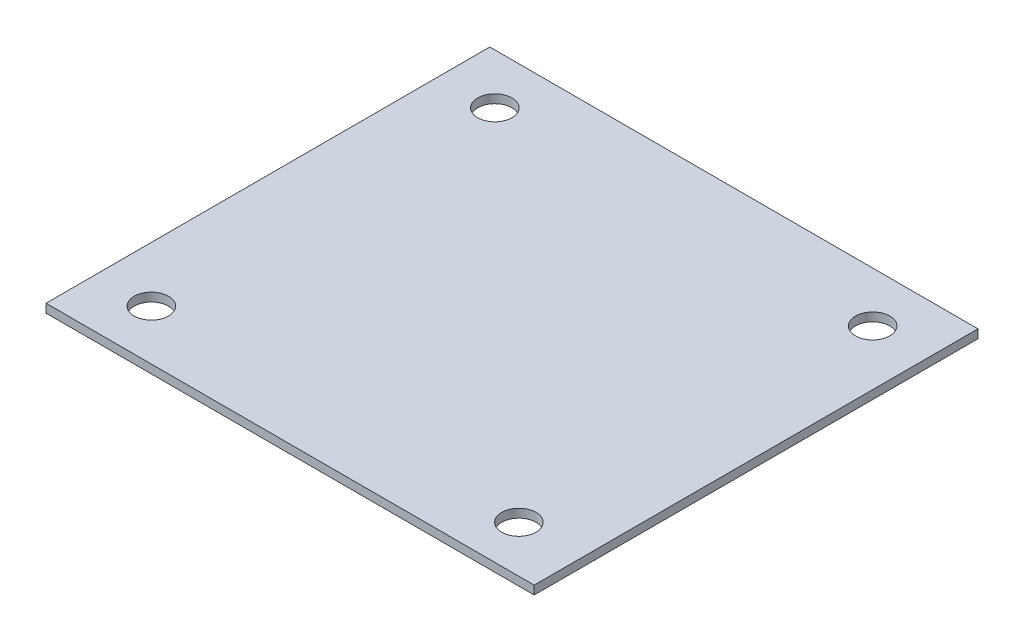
from build123d import *

# Parameters (mm, degrees)
SKETCH1_W           = 142.132800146
SKETCH1_H           = 129.211636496
SKETCH1_R           = 5
BOSS_EXTRUDE1_DEPTH = 2.5


with BuildPart() as part:
    # Sketch1 → Boss-Extrude1 (new body)
    with BuildSketch(Plane(origin=(0, 0, 0), x_dir=(1, 0, 0), z_dir=(0, 1, 0))):
        Rectangle(SKETCH1_W, SKETCH1_H)
        with Locations(Location((-54.998425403, -49.998568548, 0), (0, 0, 270))):
            Circle(SKETCH1_R, mode=Mode.SUBTRACT)
        with Locations(Location((53, -51, 0), (0, 0, 270))):
            Circle(SKETCH1_R, mode=Mode.SUBTRACT)
        with Locations(Location((-55, 50, 0), (0, 0, 270))):
            Circle(SKETCH1_R, mode=Mode.SUBTRACT)
        with Locations(Location((55, 50, 0), (0, 0, 270))):
            Circle(SKETCH1_R, mode=Mode.SUBTRACT)
    extrude(amount=-BOSS_EXTRUDE1_DEPTH)


solid = part.part
